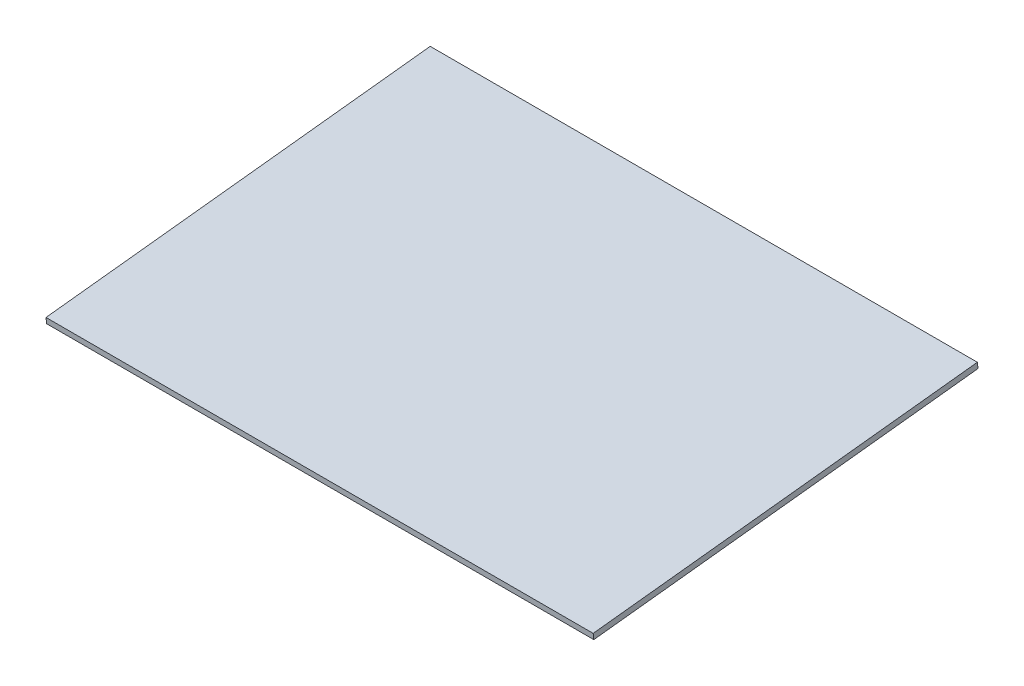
ISO-10303-21;
HEADER;
FILE_DESCRIPTION(('STEP AP214'),'2;1');
FILE_NAME('part.step','',(''),(''),'','','');
FILE_SCHEMA(('AUTOMOTIVE_DESIGN { 1 0 10303 214 1 1 1 1 }'));
ENDSEC;
DATA;
#1=APPLICATION_CONTEXT('core data for automotive mechanical design processes');
#2=APPLICATION_PROTOCOL_DEFINITION('international standard','automotive_design',2000,#1);
#3=PRODUCT_CONTEXT('',#1,'mechanical');
#4=PRODUCT('Part','Part','',(#3));
#5=PRODUCT_RELATED_PRODUCT_CATEGORY('part','',(#4));
#6=PRODUCT_DEFINITION_FORMATION('','',#4);
#7=PRODUCT_DEFINITION_CONTEXT('part definition',#1,'design');
#8=PRODUCT_DEFINITION('design','',#6,#7);
#9=PRODUCT_DEFINITION_SHAPE('','',#8);
#10=(LENGTH_UNIT() NAMED_UNIT(*) SI_UNIT(.MILLI.,.METRE.));
#11=(NAMED_UNIT(*) PLANE_ANGLE_UNIT() SI_UNIT($,.RADIAN.));
#12=(NAMED_UNIT(*) SI_UNIT($,.STERADIAN.) SOLID_ANGLE_UNIT());
#13=UNCERTAINTY_MEASURE_WITH_UNIT(LENGTH_MEASURE(1.E-05),#10,'distance_accuracy_value','');
#14=(GEOMETRIC_REPRESENTATION_CONTEXT(3) GLOBAL_UNCERTAINTY_ASSIGNED_CONTEXT((#13)) GLOBAL_UNIT_ASSIGNED_CONTEXT((#10,
#11,#12)) REPRESENTATION_CONTEXT('',''));
#15=CARTESIAN_POINT('',(0.,0.,0.));
#16=DIRECTION('',(0.,0.,1.));
#17=DIRECTION('',(1.,0.,0.));
#18=AXIS2_PLACEMENT_3D('',#15,#16,#17);
#19=CARTESIAN_POINT('',(-433.89843747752,37.,-98.9999999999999));
#20=DIRECTION('',(0.,0.993883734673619,0.110431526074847));
#21=DIRECTION('',(0.,-0.110431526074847,0.993883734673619));
#22=AXIS2_PLACEMENT_3D('',#19,#20,#21);
#23=PLANE('',#22);
#24=DIRECTION('',(1.,0.,0.));
#25=VECTOR('',#24,1.);
#26=CARTESIAN_POINT('',(-433.89843747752,15.,99.));
#27=LINE('',#26,#25);
#28=CARTESIAN_POINT('',(-231.,15.,99.));
#29=VERTEX_POINT('',#28);
#30=CARTESIAN_POINT('',(51.,15.,99.));
#31=VERTEX_POINT('',#30);
#32=EDGE_CURVE('E72',#29,#31,#27,.T.);
#33=ORIENTED_EDGE('',*,*,#32,.F.);
#34=DIRECTION('',(0.,0.110431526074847,-0.993883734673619));
#35=VECTOR('',#34,1.);
#36=CARTESIAN_POINT('',(-231.,37.,-98.9999999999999));
#37=LINE('',#36,#35);
#38=CARTESIAN_POINT('',(-231.,37.,-98.9999999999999));
#39=VERTEX_POINT('',#38);
#40=EDGE_CURVE('E42',#29,#39,#37,.T.);
#41=ORIENTED_EDGE('',*,*,#40,.T.);
#42=DIRECTION('',(1.,0.,0.));
#43=VECTOR('',#42,1.);
#44=CARTESIAN_POINT('',(-433.89843747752,37.,-98.9999999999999));
#45=LINE('',#44,#43);
#46=CARTESIAN_POINT('',(51.,37.,-98.9999999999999));
#47=VERTEX_POINT('',#46);
#48=EDGE_CURVE('E85',#39,#47,#45,.T.);
#49=ORIENTED_EDGE('',*,*,#48,.T.);
#50=DIRECTION('',(0.,-0.110431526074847,0.993883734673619));
#51=VECTOR('',#50,1.);
#52=CARTESIAN_POINT('',(51.,37.,-98.9999999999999));
#53=LINE('',#52,#51);
#54=EDGE_CURVE('E83',#47,#31,#53,.T.);
#55=ORIENTED_EDGE('',*,*,#54,.T.);
#56=EDGE_LOOP('',(#33,#41,#49,#55));
#57=FACE_BOUND('',#56,.T.);
#58=ADVANCED_FACE('F35',(#57),#23,.F.);
#59=CARTESIAN_POINT('',(-433.89843747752,17.9816512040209,99.3312945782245));
#60=DIRECTION('',(0.,-0.110431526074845,0.993883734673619));
#61=DIRECTION('',(0.,-0.993883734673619,-0.110431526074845));
#62=AXIS2_PLACEMENT_3D('',#59,#60,#61);
#63=PLANE('',#62);
#64=DIRECTION('',(0.,0.993883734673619,0.110431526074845));
#65=VECTOR('',#64,1.);
#66=CARTESIAN_POINT('',(-231.,17.9816512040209,99.3312945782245));
#67=LINE('',#66,#65);
#68=CARTESIAN_POINT('',(-231.,17.9816512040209,99.3312945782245));
#69=VERTEX_POINT('',#68);
#70=EDGE_CURVE('E49',#29,#69,#67,.T.);
#71=ORIENTED_EDGE('',*,*,#70,.F.);
#72=ORIENTED_EDGE('',*,*,#32,.T.);
#73=DIRECTION('',(0.,-0.993883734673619,-0.110431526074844));
#74=VECTOR('',#73,1.);
#75=CARTESIAN_POINT('',(51.,17.9816512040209,99.3312945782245));
#76=LINE('',#75,#74);
#77=CARTESIAN_POINT('',(51.,17.9816512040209,99.3312945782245));
#78=VERTEX_POINT('',#77);
#79=EDGE_CURVE('E77',#78,#31,#76,.T.);
#80=ORIENTED_EDGE('',*,*,#79,.F.);
#81=DIRECTION('',(1.,0.,0.));
#82=VECTOR('',#81,1.);
#83=CARTESIAN_POINT('',(-433.89843747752,17.9816512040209,99.3312945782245));
#84=LINE('',#83,#82);
#85=EDGE_CURVE('E81',#69,#78,#84,.T.);
#86=ORIENTED_EDGE('',*,*,#85,.F.);
#87=EDGE_LOOP('',(#71,#72,#80,#86));
#88=FACE_BOUND('',#87,.T.);
#89=ADVANCED_FACE('F74',(#88),#63,.T.);
#90=CARTESIAN_POINT('',(-433.89843747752,39.9816512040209,-98.6687054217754));
#91=DIRECTION('',(0.,0.993883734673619,0.110431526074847));
#92=DIRECTION('',(0.,-0.110431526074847,0.993883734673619));
#93=AXIS2_PLACEMENT_3D('',#90,#91,#92);
#94=PLANE('',#93);
#95=DIRECTION('',(0.,0.110431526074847,-0.993883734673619));
#96=VECTOR('',#95,1.);
#97=CARTESIAN_POINT('',(-231.,39.9816512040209,-98.6687054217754));
#98=LINE('',#97,#96);
#99=CARTESIAN_POINT('',(-231.,39.9816512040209,-98.6687054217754));
#100=VERTEX_POINT('',#99);
#101=EDGE_CURVE('E80',#69,#100,#98,.T.);
#102=ORIENTED_EDGE('',*,*,#101,.F.);
#103=ORIENTED_EDGE('',*,*,#85,.T.);
#104=DIRECTION('',(0.,-0.110431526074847,0.993883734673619));
#105=VECTOR('',#104,1.);
#106=CARTESIAN_POINT('',(51.,39.9816512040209,-98.6687054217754));
#107=LINE('',#106,#105);
#108=CARTESIAN_POINT('',(51.,39.9816512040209,-98.6687054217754));
#109=VERTEX_POINT('',#108);
#110=EDGE_CURVE('E92',#109,#78,#107,.T.);
#111=ORIENTED_EDGE('',*,*,#110,.F.);
#112=DIRECTION('',(1.,0.,0.));
#113=VECTOR('',#112,1.);
#114=CARTESIAN_POINT('',(-433.89843747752,39.9816512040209,-98.6687054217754));
#115=LINE('',#114,#113);
#116=EDGE_CURVE('E100',#100,#109,#115,.T.);
#117=ORIENTED_EDGE('',*,*,#116,.F.);
#118=EDGE_LOOP('',(#102,#103,#111,#117));
#119=FACE_BOUND('',#118,.T.);
#120=ADVANCED_FACE('F103',(#119),#94,.T.);
#121=CARTESIAN_POINT('',(-433.89843747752,37.,-98.9999999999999));
#122=DIRECTION('',(0.,0.110431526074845,-0.993883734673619));
#123=DIRECTION('',(0.,0.993883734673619,0.110431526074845));
#124=AXIS2_PLACEMENT_3D('',#121,#122,#123);
#125=PLANE('',#124);
#126=DIRECTION('',(0.,-0.993883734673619,-0.110431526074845));
#127=VECTOR('',#126,1.);
#128=CARTESIAN_POINT('',(-231.,37.,-98.9999999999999));
#129=LINE('',#128,#127);
#130=EDGE_CURVE('E11',#100,#39,#129,.T.);
#131=ORIENTED_EDGE('',*,*,#130,.F.);
#132=ORIENTED_EDGE('',*,*,#116,.T.);
#133=DIRECTION('',(0.,0.993883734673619,0.110431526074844));
#134=VECTOR('',#133,1.);
#135=CARTESIAN_POINT('',(51.,37.,-98.9999999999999));
#136=LINE('',#135,#134);
#137=EDGE_CURVE('E94',#47,#109,#136,.T.);
#138=ORIENTED_EDGE('',*,*,#137,.F.);
#139=ORIENTED_EDGE('',*,*,#48,.F.);
#140=EDGE_LOOP('',(#131,#132,#138,#139));
#141=FACE_BOUND('',#140,.T.);
#142=ADVANCED_FACE('F108',(#141),#125,.T.);
#143=CARTESIAN_POINT('',(51.,0.,0.));
#144=DIRECTION('',(1.,0.,0.));
#145=DIRECTION('',(0.,0.,-1.));
#146=AXIS2_PLACEMENT_3D('',#143,#144,#145);
#147=PLANE('',#146);
#148=ORIENTED_EDGE('',*,*,#54,.F.);
#149=ORIENTED_EDGE('',*,*,#137,.T.);
#150=ORIENTED_EDGE('',*,*,#110,.T.);
#151=ORIENTED_EDGE('',*,*,#79,.T.);
#152=EDGE_LOOP('',(#148,#149,#150,#151));
#153=FACE_BOUND('',#152,.T.);
#154=ADVANCED_FACE('F90',(#153),#147,.T.);
#155=CARTESIAN_POINT('',(-231.,0.,0.));
#156=DIRECTION('',(1.,0.,0.));
#157=DIRECTION('',(0.,0.,-1.));
#158=AXIS2_PLACEMENT_3D('',#155,#156,#157);
#159=PLANE('',#158);
#160=ORIENTED_EDGE('',*,*,#70,.T.);
#161=ORIENTED_EDGE('',*,*,#101,.T.);
#162=ORIENTED_EDGE('',*,*,#130,.T.);
#163=ORIENTED_EDGE('',*,*,#40,.F.);
#164=EDGE_LOOP('',(#160,#161,#162,#163));
#165=FACE_BOUND('',#164,.T.);
#166=ADVANCED_FACE('F115',(#165),#159,.F.);
#167=CLOSED_SHELL('',(#58,#89,#120,#142,#154,#166));
#168=MANIFOLD_SOLID_BREP('B2',#167);
#169=ADVANCED_BREP_SHAPE_REPRESENTATION('',(#18,#168),#14);
#170=SHAPE_DEFINITION_REPRESENTATION(#9,#169);
ENDSEC;
END-ISO-10303-21;
